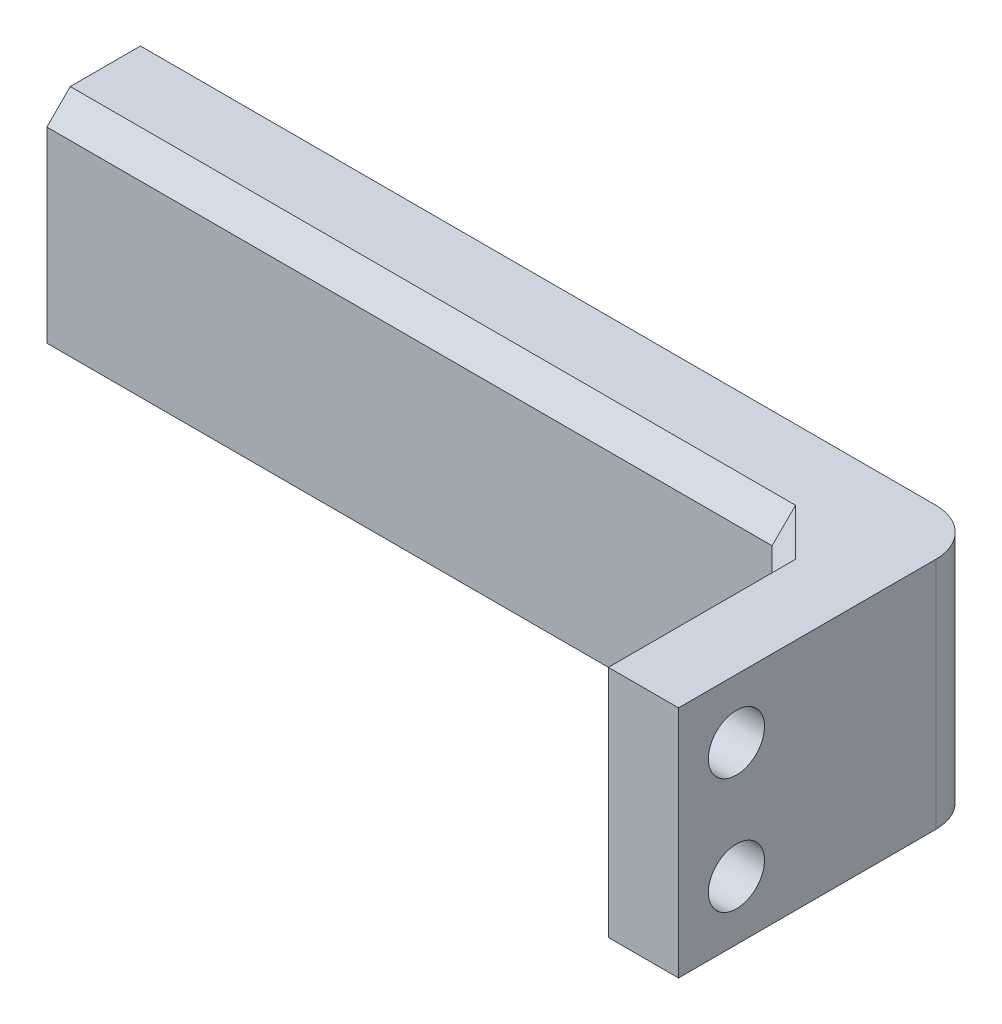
ISO-10303-21;
HEADER;
FILE_DESCRIPTION(('STEP AP214'),'2;1');
FILE_NAME('part.step','',(''),(''),'','','');
FILE_SCHEMA(('AUTOMOTIVE_DESIGN { 1 0 10303 214 1 1 1 1 }'));
ENDSEC;
DATA;
#1=APPLICATION_CONTEXT('core data for automotive mechanical design processes');
#2=APPLICATION_PROTOCOL_DEFINITION('international standard','automotive_design',2000,#1);
#3=PRODUCT_CONTEXT('',#1,'mechanical');
#4=PRODUCT('Part','Part','',(#3));
#5=PRODUCT_RELATED_PRODUCT_CATEGORY('part','',(#4));
#6=PRODUCT_DEFINITION_FORMATION('','',#4);
#7=PRODUCT_DEFINITION_CONTEXT('part definition',#1,'design');
#8=PRODUCT_DEFINITION('design','',#6,#7);
#9=PRODUCT_DEFINITION_SHAPE('','',#8);
#10=(LENGTH_UNIT() NAMED_UNIT(*) SI_UNIT(.MILLI.,.METRE.));
#11=(NAMED_UNIT(*) PLANE_ANGLE_UNIT() SI_UNIT($,.RADIAN.));
#12=(NAMED_UNIT(*) SI_UNIT($,.STERADIAN.) SOLID_ANGLE_UNIT());
#13=UNCERTAINTY_MEASURE_WITH_UNIT(LENGTH_MEASURE(1.E-05),#10,'distance_accuracy_value','');
#14=(GEOMETRIC_REPRESENTATION_CONTEXT(3) GLOBAL_UNCERTAINTY_ASSIGNED_CONTEXT((#13)) GLOBAL_UNIT_ASSIGNED_CONTEXT((#10,
#11,#12)) REPRESENTATION_CONTEXT('',''));
#15=CARTESIAN_POINT('',(0.,0.,0.));
#16=DIRECTION('',(0.,0.,1.));
#17=DIRECTION('',(1.,0.,0.));
#18=AXIS2_PLACEMENT_3D('',#15,#16,#17);
#19=CARTESIAN_POINT('',(0.,2.,0.));
#20=DIRECTION('',(0.,1.,0.));
#21=DIRECTION('',(0.,0.,1.));
#22=AXIS2_PLACEMENT_3D('',#19,#20,#21);
#23=PLANE('',#22);
#24=DIRECTION('',(-1.,0.,0.));
#25=VECTOR('',#24,1.);
#26=CARTESIAN_POINT('',(0.,2.,13.));
#27=LINE('',#26,#25);
#28=CARTESIAN_POINT('',(36.,2.,13.));
#29=VERTEX_POINT('',#28);
#30=CARTESIAN_POINT('',(33.,2.,13.));
#31=VERTEX_POINT('',#30);
#32=EDGE_CURVE('E198',#29,#31,#27,.T.);
#33=ORIENTED_EDGE('',*,*,#32,.T.);
#34=DIRECTION('',(0.,0.,-1.));
#35=VECTOR('',#34,1.);
#36=CARTESIAN_POINT('',(33.,2.,0.));
#37=LINE('',#36,#35);
#38=CARTESIAN_POINT('',(33.,2.,5.));
#39=VERTEX_POINT('',#38);
#40=EDGE_CURVE('E11',#31,#39,#37,.T.);
#41=ORIENTED_EDGE('',*,*,#40,.T.);
#42=DIRECTION('',(0.707106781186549,0.,0.707106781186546));
#43=VECTOR('',#42,1.);
#44=CARTESIAN_POINT('',(33.,2.,5.));
#45=LINE('',#44,#43);
#46=CARTESIAN_POINT('',(32.,2.,4.));
#47=VERTEX_POINT('',#46);
#48=EDGE_CURVE('E53',#47,#39,#45,.T.);
#49=ORIENTED_EDGE('',*,*,#48,.F.);
#50=DIRECTION('',(0.707106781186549,0.,0.707106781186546));
#51=VECTOR('',#50,1.);
#52=CARTESIAN_POINT('',(33.,2.,5.));
#53=LINE('',#52,#51);
#54=CARTESIAN_POINT('',(31.,2.,3.));
#55=VERTEX_POINT('',#54);
#56=EDGE_CURVE('E65',#55,#47,#53,.T.);
#57=ORIENTED_EDGE('',*,*,#56,.F.);
#58=DIRECTION('',(-1.,0.,0.));
#59=VECTOR('',#58,1.);
#60=CARTESIAN_POINT('',(0.,2.,3.));
#61=LINE('',#60,#59);
#62=CARTESIAN_POINT('',(0.,2.,3.));
#63=VERTEX_POINT('',#62);
#64=EDGE_CURVE('E308',#55,#63,#61,.T.);
#65=ORIENTED_EDGE('',*,*,#64,.T.);
#66=DIRECTION('',(0.,0.,1.));
#67=VECTOR('',#66,1.);
#68=CARTESIAN_POINT('',(0.,2.,0.));
#69=LINE('',#68,#67);
#70=CARTESIAN_POINT('',(0.,2.,0.));
#71=VERTEX_POINT('',#70);
#72=EDGE_CURVE('E162',#71,#63,#69,.T.);
#73=ORIENTED_EDGE('',*,*,#72,.F.);
#74=DIRECTION('',(-1.,0.,0.));
#75=VECTOR('',#74,1.);
#76=CARTESIAN_POINT('',(0.,2.,0.));
#77=LINE('',#76,#75);
#78=CARTESIAN_POINT('',(34.,2.,0.));
#79=VERTEX_POINT('',#78);
#80=EDGE_CURVE('E177',#79,#71,#77,.T.);
#81=ORIENTED_EDGE('',*,*,#80,.F.);
#82=CARTESIAN_POINT('',(34.,2.,2.));
#83=DIRECTION('',(0.,1.,0.));
#84=DIRECTION('',(0.,0.,1.));
#85=AXIS2_PLACEMENT_3D('',#82,#83,#84);
#86=CIRCLE('',#85,2.);
#87=CARTESIAN_POINT('',(36.,2.,2.));
#88=VERTEX_POINT('',#87);
#89=EDGE_CURVE('E214',#79,#88,#86,.F.);
#90=ORIENTED_EDGE('',*,*,#89,.T.);
#91=DIRECTION('',(0.,0.,1.));
#92=VECTOR('',#91,1.);
#93=CARTESIAN_POINT('',(36.,2.,0.));
#94=LINE('',#93,#92);
#95=EDGE_CURVE('E370',#88,#29,#94,.T.);
#96=ORIENTED_EDGE('',*,*,#95,.T.);
#97=EDGE_LOOP('',(#33,#41,#49,#57,#65,#73,#81,#90,#96));
#98=FACE_BOUND('',#97,.T.);
#99=ADVANCED_FACE('F41',(#98),#23,.F.);
#100=CARTESIAN_POINT('',(36.,12.,0.));
#101=DIRECTION('',(0.,-1.,0.));
#102=DIRECTION('',(1.,0.,0.));
#103=AXIS2_PLACEMENT_3D('',#100,#101,#102);
#104=PLANE('',#103);
#105=DIRECTION('',(0.,0.,1.));
#106=VECTOR('',#105,1.);
#107=CARTESIAN_POINT('',(0.,12.,0.));
#108=LINE('',#107,#106);
#109=CARTESIAN_POINT('',(0.,12.,0.));
#110=VERTEX_POINT('',#109);
#111=CARTESIAN_POINT('',(0.,12.,3.));
#112=VERTEX_POINT('',#111);
#113=EDGE_CURVE('E154',#110,#112,#108,.T.);
#114=ORIENTED_EDGE('',*,*,#113,.T.);
#115=DIRECTION('',(1.,0.,0.));
#116=VECTOR('',#115,1.);
#117=CARTESIAN_POINT('',(32.,12.,3.));
#118=LINE('',#117,#116);
#119=CARTESIAN_POINT('',(31.,12.,3.));
#120=VERTEX_POINT('',#119);
#121=EDGE_CURVE('E251',#112,#120,#118,.T.);
#122=ORIENTED_EDGE('',*,*,#121,.T.);
#123=DIRECTION('',(-0.707106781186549,0.,-0.707106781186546));
#124=VECTOR('',#123,1.);
#125=CARTESIAN_POINT('',(31.,12.,3.00000000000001));
#126=LINE('',#125,#124);
#127=CARTESIAN_POINT('',(32.,12.,4.));
#128=VERTEX_POINT('',#127);
#129=EDGE_CURVE('E247',#128,#120,#126,.T.);
#130=ORIENTED_EDGE('',*,*,#129,.F.);
#131=DIRECTION('',(-0.707106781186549,0.,-0.707106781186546));
#132=VECTOR('',#131,1.);
#133=CARTESIAN_POINT('',(31.,12.,3.00000000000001));
#134=LINE('',#133,#132);
#135=CARTESIAN_POINT('',(33.,12.,5.));
#136=VERTEX_POINT('',#135);
#137=EDGE_CURVE('E243',#136,#128,#134,.T.);
#138=ORIENTED_EDGE('',*,*,#137,.F.);
#139=DIRECTION('',(0.,0.,1.));
#140=VECTOR('',#139,1.);
#141=CARTESIAN_POINT('',(33.,12.,0.));
#142=LINE('',#141,#140);
#143=CARTESIAN_POINT('',(33.,12.,13.));
#144=VERTEX_POINT('',#143);
#145=EDGE_CURVE('E240',#136,#144,#142,.T.);
#146=ORIENTED_EDGE('',*,*,#145,.T.);
#147=DIRECTION('',(-1.,0.,0.));
#148=VECTOR('',#147,1.);
#149=CARTESIAN_POINT('',(0.,12.,13.));
#150=LINE('',#149,#148);
#151=CARTESIAN_POINT('',(36.,12.,13.));
#152=VERTEX_POINT('',#151);
#153=EDGE_CURVE('E185',#152,#144,#150,.T.);
#154=ORIENTED_EDGE('',*,*,#153,.F.);
#155=DIRECTION('',(0.,0.,1.));
#156=VECTOR('',#155,1.);
#157=CARTESIAN_POINT('',(36.,12.,0.));
#158=LINE('',#157,#156);
#159=CARTESIAN_POINT('',(36.,12.,2.));
#160=VERTEX_POINT('',#159);
#161=EDGE_CURVE('E173',#160,#152,#158,.T.);
#162=ORIENTED_EDGE('',*,*,#161,.F.);
#163=CARTESIAN_POINT('',(34.,12.,2.));
#164=DIRECTION('',(0.,-1.,0.));
#165=DIRECTION('',(1.,0.,0.));
#166=AXIS2_PLACEMENT_3D('',#163,#164,#165);
#167=CIRCLE('',#166,2.);
#168=CARTESIAN_POINT('',(34.,12.,0.));
#169=VERTEX_POINT('',#168);
#170=EDGE_CURVE('E157',#160,#169,#167,.F.);
#171=ORIENTED_EDGE('',*,*,#170,.T.);
#172=DIRECTION('',(1.,0.,0.));
#173=VECTOR('',#172,1.);
#174=CARTESIAN_POINT('',(36.,12.,0.));
#175=LINE('',#174,#173);
#176=EDGE_CURVE('E151',#110,#169,#175,.T.);
#177=ORIENTED_EDGE('',*,*,#176,.F.);
#178=EDGE_LOOP('',(#114,#122,#130,#138,#146,#154,#162,#171,#177));
#179=FACE_BOUND('',#178,.T.);
#180=ADVANCED_FACE('F153',(#179),#104,.F.);
#181=CARTESIAN_POINT('',(36.,0.,4.));
#182=DIRECTION('',(-1.,0.,0.));
#183=DIRECTION('',(0.,0.,1.));
#184=AXIS2_PLACEMENT_3D('',#181,#182,#183);
#185=PLANE('',#184);
#186=CARTESIAN_POINT('',(36.,9.47487373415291,10.5251262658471));
#187=DIRECTION('',(-1.,0.,0.));
#188=DIRECTION('',(0.,0.,1.));
#189=AXIS2_PLACEMENT_3D('',#186,#187,#188);
#190=CIRCLE('',#189,1.2);
#191=CARTESIAN_POINT('',(36.,9.47487373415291,11.7251262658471));
#192=VERTEX_POINT('',#191);
#193=EDGE_CURVE('E200',#192,#192,#190,.T.);
#194=ORIENTED_EDGE('',*,*,#193,.T.);
#195=EDGE_LOOP('',(#194));
#196=FACE_BOUND('',#195,.T.);
#197=CARTESIAN_POINT('',(36.,4.52512626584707,10.5251262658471));
#198=DIRECTION('',(-1.,0.,0.));
#199=DIRECTION('',(0.,0.,1.));
#200=AXIS2_PLACEMENT_3D('',#197,#198,#199);
#201=CIRCLE('',#200,1.2);
#202=CARTESIAN_POINT('',(36.,4.52512626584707,11.7251262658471));
#203=VERTEX_POINT('',#202);
#204=EDGE_CURVE('E194',#203,#203,#201,.T.);
#205=ORIENTED_EDGE('',*,*,#204,.T.);
#206=EDGE_LOOP('',(#205));
#207=FACE_BOUND('',#206,.T.);
#208=ORIENTED_EDGE('',*,*,#95,.F.);
#209=DIRECTION('',(0.,1.,0.));
#210=VECTOR('',#209,1.);
#211=CARTESIAN_POINT('',(36.,0.,2.));
#212=LINE('',#211,#210);
#213=EDGE_CURVE('E193',#88,#160,#212,.T.);
#214=ORIENTED_EDGE('',*,*,#213,.T.);
#215=ORIENTED_EDGE('',*,*,#161,.T.);
#216=DIRECTION('',(0.,1.,0.));
#217=VECTOR('',#216,1.);
#218=CARTESIAN_POINT('',(36.,14.,13.));
#219=LINE('',#218,#217);
#220=EDGE_CURVE('E181',#29,#152,#219,.T.);
#221=ORIENTED_EDGE('',*,*,#220,.F.);
#222=EDGE_LOOP('',(#208,#214,#215,#221));
#223=FACE_BOUND('',#222,.T.);
#224=ADVANCED_FACE('F386',(#196,#207,#223),#185,.F.);
#225=CARTESIAN_POINT('',(0.,0.,4.));
#226=DIRECTION('',(-1.,0.,0.));
#227=DIRECTION('',(0.,0.,1.));
#228=AXIS2_PLACEMENT_3D('',#225,#226,#227);
#229=PLANE('',#228);
#230=DIRECTION('',(0.,1.,0.));
#231=VECTOR('',#230,1.);
#232=CARTESIAN_POINT('',(0.,0.,4.));
#233=LINE('',#232,#231);
#234=CARTESIAN_POINT('',(0.,3.,4.));
#235=VERTEX_POINT('',#234);
#236=CARTESIAN_POINT('',(0.,11.,4.));
#237=VERTEX_POINT('',#236);
#238=EDGE_CURVE('E180',#235,#237,#233,.T.);
#239=ORIENTED_EDGE('',*,*,#238,.T.);
#240=DIRECTION('',(0.,0.707106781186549,-0.707106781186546));
#241=VECTOR('',#240,1.);
#242=CARTESIAN_POINT('',(0.,5.49999999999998,9.5));
#243=LINE('',#242,#241);
#244=EDGE_CURVE('E171',#237,#112,#243,.T.);
#245=ORIENTED_EDGE('',*,*,#244,.T.);
#246=ORIENTED_EDGE('',*,*,#113,.F.);
#247=DIRECTION('',(0.,1.,0.));
#248=VECTOR('',#247,1.);
#249=CARTESIAN_POINT('',(0.,0.,0.));
#250=LINE('',#249,#248);
#251=EDGE_CURVE('E169',#71,#110,#250,.T.);
#252=ORIENTED_EDGE('',*,*,#251,.F.);
#253=ORIENTED_EDGE('',*,*,#72,.T.);
#254=DIRECTION('',(0.,0.707106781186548,0.707106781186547));
#255=VECTOR('',#254,1.);
#256=CARTESIAN_POINT('',(0.,1.5,2.5));
#257=LINE('',#256,#255);
#258=EDGE_CURVE('E254',#63,#235,#257,.T.);
#259=ORIENTED_EDGE('',*,*,#258,.T.);
#260=EDGE_LOOP('',(#239,#245,#246,#252,#253,#259));
#261=FACE_BOUND('',#260,.T.);
#262=ADVANCED_FACE('F167',(#261),#229,.T.);
#263=CARTESIAN_POINT('',(0.,0.,4.));
#264=DIRECTION('',(0.,0.,1.));
#265=DIRECTION('',(1.,0.,0.));
#266=AXIS2_PLACEMENT_3D('',#263,#264,#265);
#267=PLANE('',#266);
#268=DIRECTION('',(0.,1.,0.));
#269=VECTOR('',#268,1.);
#270=CARTESIAN_POINT('',(31.,0.,4.));
#271=LINE('',#270,#269);
#272=CARTESIAN_POINT('',(31.,3.,4.));
#273=VERTEX_POINT('',#272);
#274=CARTESIAN_POINT('',(31.,11.,4.));
#275=VERTEX_POINT('',#274);
#276=EDGE_CURVE('E233',#273,#275,#271,.T.);
#277=ORIENTED_EDGE('',*,*,#276,.T.);
#278=DIRECTION('',(-1.,0.,0.));
#279=VECTOR('',#278,1.);
#280=CARTESIAN_POINT('',(0.,11.,4.));
#281=LINE('',#280,#279);
#282=EDGE_CURVE('E237',#275,#237,#281,.T.);
#283=ORIENTED_EDGE('',*,*,#282,.T.);
#284=ORIENTED_EDGE('',*,*,#238,.F.);
#285=DIRECTION('',(1.,0.,0.));
#286=VECTOR('',#285,1.);
#287=CARTESIAN_POINT('',(32.,3.,4.));
#288=LINE('',#287,#286);
#289=EDGE_CURVE('E230',#235,#273,#288,.T.);
#290=ORIENTED_EDGE('',*,*,#289,.T.);
#291=EDGE_LOOP('',(#277,#283,#284,#290));
#292=FACE_BOUND('',#291,.T.);
#293=ADVANCED_FACE('F434',(#292),#267,.T.);
#294=CARTESIAN_POINT('',(0.,0.,0.));
#295=DIRECTION('',(0.,0.,1.));
#296=DIRECTION('',(1.,0.,0.));
#297=AXIS2_PLACEMENT_3D('',#294,#295,#296);
#298=PLANE('',#297);
#299=ORIENTED_EDGE('',*,*,#176,.T.);
#300=DIRECTION('',(0.,1.,0.));
#301=VECTOR('',#300,1.);
#302=CARTESIAN_POINT('',(34.,0.,0.));
#303=LINE('',#302,#301);
#304=EDGE_CURVE('E211',#169,#79,#303,.F.);
#305=ORIENTED_EDGE('',*,*,#304,.T.);
#306=ORIENTED_EDGE('',*,*,#80,.T.);
#307=ORIENTED_EDGE('',*,*,#251,.T.);
#308=EDGE_LOOP('',(#299,#305,#306,#307));
#309=FACE_BOUND('',#308,.T.);
#310=ADVANCED_FACE('F175',(#309),#298,.F.);
#311=CARTESIAN_POINT('',(32.,14.,13.));
#312=DIRECTION('',(1.,0.,0.));
#313=DIRECTION('',(0.,0.,-1.));
#314=AXIS2_PLACEMENT_3D('',#311,#312,#313);
#315=PLANE('',#314);
#316=CARTESIAN_POINT('',(32.,4.52512626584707,10.5251262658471));
#317=DIRECTION('',(-1.,0.,0.));
#318=DIRECTION('',(0.,0.,1.));
#319=AXIS2_PLACEMENT_3D('',#316,#317,#318);
#320=CIRCLE('',#319,2.2);
#321=CARTESIAN_POINT('',(32.,6.15753168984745,12.));
#322=VERTEX_POINT('',#321);
#323=CARTESIAN_POINT('',(32.,3.,8.93956962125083));
#324=VERTEX_POINT('',#323);
#325=EDGE_CURVE('E204',#322,#324,#320,.T.);
#326=ORIENTED_EDGE('',*,*,#325,.F.);
#327=DIRECTION('',(0.,1.,0.));
#328=VECTOR('',#327,1.);
#329=CARTESIAN_POINT('',(32.,14.,12.));
#330=LINE('',#329,#328);
#331=CARTESIAN_POINT('',(32.,7.84246831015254,12.));
#332=VERTEX_POINT('',#331);
#333=EDGE_CURVE('E227',#322,#332,#330,.T.);
#334=ORIENTED_EDGE('',*,*,#333,.T.);
#335=CARTESIAN_POINT('',(32.,9.47487373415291,10.5251262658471));
#336=DIRECTION('',(-1.,0.,0.));
#337=DIRECTION('',(0.,0.,1.));
#338=AXIS2_PLACEMENT_3D('',#335,#336,#337);
#339=CIRCLE('',#338,2.2);
#340=CARTESIAN_POINT('',(32.,11.,8.93956962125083));
#341=VERTEX_POINT('',#340);
#342=EDGE_CURVE('E345',#341,#332,#339,.T.);
#343=ORIENTED_EDGE('',*,*,#342,.F.);
#344=DIRECTION('',(0.,0.,-1.));
#345=VECTOR('',#344,1.);
#346=CARTESIAN_POINT('',(32.,11.,13.));
#347=LINE('',#346,#345);
#348=CARTESIAN_POINT('',(32.,11.,5.));
#349=VERTEX_POINT('',#348);
#350=EDGE_CURVE('E224',#341,#349,#347,.T.);
#351=ORIENTED_EDGE('',*,*,#350,.T.);
#352=DIRECTION('',(0.,-1.,0.));
#353=VECTOR('',#352,1.);
#354=CARTESIAN_POINT('',(32.,14.,5.));
#355=LINE('',#354,#353);
#356=CARTESIAN_POINT('',(32.,3.,5.));
#357=VERTEX_POINT('',#356);
#358=EDGE_CURVE('E220',#349,#357,#355,.T.);
#359=ORIENTED_EDGE('',*,*,#358,.T.);
#360=DIRECTION('',(0.,0.,1.));
#361=VECTOR('',#360,1.);
#362=CARTESIAN_POINT('',(32.,3.,13.));
#363=LINE('',#362,#361);
#364=EDGE_CURVE('E217',#357,#324,#363,.T.);
#365=ORIENTED_EDGE('',*,*,#364,.T.);
#366=EDGE_LOOP('',(#326,#334,#343,#351,#359,#365));
#367=FACE_BOUND('',#366,.T.);
#368=ADVANCED_FACE('F396',(#367),#315,.F.);
#369=CARTESIAN_POINT('',(0.,0.,13.));
#370=DIRECTION('',(0.,0.,-1.));
#371=DIRECTION('',(-1.,0.,0.));
#372=AXIS2_PLACEMENT_3D('',#369,#370,#371);
#373=PLANE('',#372);
#374=ORIENTED_EDGE('',*,*,#153,.T.);
#375=DIRECTION('',(0.,-1.,0.));
#376=VECTOR('',#375,1.);
#377=CARTESIAN_POINT('',(33.,0.,13.));
#378=LINE('',#377,#376);
#379=EDGE_CURVE('E385',#144,#31,#378,.T.);
#380=ORIENTED_EDGE('',*,*,#379,.T.);
#381=ORIENTED_EDGE('',*,*,#32,.F.);
#382=ORIENTED_EDGE('',*,*,#220,.T.);
#383=EDGE_LOOP('',(#374,#380,#381,#382));
#384=FACE_BOUND('',#383,.T.);
#385=ADVANCED_FACE('F383',(#384),#373,.F.);
#386=CARTESIAN_POINT('',(32.,4.52512626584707,10.5251262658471));
#387=DIRECTION('',(-1.,0.,0.));
#388=DIRECTION('',(0.,0.,1.));
#389=AXIS2_PLACEMENT_3D('',#386,#387,#388);
#390=CYLINDRICAL_SURFACE('',#389,1.2);
#391=CARTESIAN_POINT('',(33.,4.52512626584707,10.5251262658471));
#392=DIRECTION('',(-1.,0.,0.));
#393=DIRECTION('',(0.,0.,1.));
#394=AXIS2_PLACEMENT_3D('',#391,#392,#393);
#395=CIRCLE('',#394,1.2);
#396=CARTESIAN_POINT('',(33.,4.52512626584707,11.7251262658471));
#397=VERTEX_POINT('',#396);
#398=EDGE_CURVE('E199',#397,#397,#395,.T.);
#399=ORIENTED_EDGE('',*,*,#398,.T.);
#400=EDGE_LOOP('',(#399));
#401=FACE_BOUND('',#400,.T.);
#402=ORIENTED_EDGE('',*,*,#204,.F.);
#403=EDGE_LOOP('',(#402));
#404=FACE_BOUND('',#403,.T.);
#405=ADVANCED_FACE('F289',(#401,#404),#390,.F.);
#406=CARTESIAN_POINT('',(32.,4.52512626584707,10.5251262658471));
#407=DIRECTION('',(-1.,0.,0.));
#408=DIRECTION('',(0.,0.,1.));
#409=AXIS2_PLACEMENT_3D('',#406,#407,#408);
#410=CONICAL_SURFACE('',#409,2.2,0.785398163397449);
#411=ORIENTED_EDGE('',*,*,#398,.F.);
#412=EDGE_LOOP('',(#411));
#413=FACE_BOUND('',#412,.T.);
#414=CARTESIAN_POINT('',(32.,3.,8.93956962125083));
#415=CARTESIAN_POINT('',(32.0374357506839,2.96256424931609,9.02750843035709));
#416=CARTESIAN_POINT('',(32.0726132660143,2.9273867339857,9.11748407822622));
#417=CARTESIAN_POINT('',(32.1376208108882,2.86237918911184,9.30153954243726));
#418=CARTESIAN_POINT('',(32.1674345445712,2.83256545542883,9.3956308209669));
#419=CARTESIAN_POINT('',(32.2206784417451,2.77932155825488,9.58752713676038));
#420=CARTESIAN_POINT('',(32.2441014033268,2.75589859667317,9.6853362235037));
#421=CARTESIAN_POINT('',(32.2835490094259,2.71645099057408,9.88380122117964));
#422=CARTESIAN_POINT('',(32.2995833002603,2.70041669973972,9.98445323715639));
#423=CARTESIAN_POINT('',(32.3204007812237,2.67959921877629,10.1610427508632));
#424=CARTESIAN_POINT('',(32.3270306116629,2.67296938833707,10.2365511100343));
#425=CARTESIAN_POINT('',(32.3356861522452,2.66431384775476,10.3880900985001));
#426=CARTESIAN_POINT('',(32.3377126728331,2.66228732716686,10.4641206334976));
#427=CARTESIAN_POINT('',(32.3371015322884,2.66289846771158,10.6159154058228));
#428=CARTESIAN_POINT('',(32.334477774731,2.66552222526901,10.6916797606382));
#429=CARTESIAN_POINT('',(32.3246721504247,2.67532784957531,10.842610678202));
#430=CARTESIAN_POINT('',(32.3174903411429,2.68250965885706,10.9177772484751));
#431=CARTESIAN_POINT('',(32.2988035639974,2.7011964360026,11.0667499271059));
#432=CARTESIAN_POINT('',(32.2873138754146,2.71268612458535,11.1405598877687));
#433=CARTESIAN_POINT('',(32.2603057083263,2.73969429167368,11.2867006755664));
#434=CARTESIAN_POINT('',(32.244785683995,2.75521431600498,11.3590309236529));
#435=CARTESIAN_POINT('',(32.1926720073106,2.80732799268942,11.57342676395));
#436=CARTESIAN_POINT('',(32.1505322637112,2.84946773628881,11.7128410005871));
#437=CARTESIAN_POINT('',(32.0803873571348,2.91961264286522,11.9104132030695));
#438=CARTESIAN_POINT('',(32.0569749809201,2.94302501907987,11.9719342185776));
#439=CARTESIAN_POINT('',(32.0324695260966,2.96753047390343,12.0324695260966));
#440=B_SPLINE_CURVE_WITH_KNOTS('',3,(#414,#415,#416,#417,#418,#419,#420,#421,#422,#423,#424,
#425,#426,#427,#428,#429,#430,#431,#432,#433,#434,#435,#436,#437,#438,#439),.UNSPECIFIED.,.F.,
.F.,(4,2,2,2,2,2,2,2,2,2,2,2,4),(0.,0.308015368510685,0.616951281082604,0.926233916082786,
1.23511161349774,1.46311644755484,1.69108113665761,1.91836539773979,2.145646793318,
2.37212957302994,2.59869934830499,3.05200948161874,3.26143738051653),.UNSPECIFIED.);
#441=CARTESIAN_POINT('',(32.0324695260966,2.96753047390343,12.0324695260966));
#442=VERTEX_POINT('',#441);
#443=EDGE_CURVE('E294',#324,#442,#440,.T.);
#444=ORIENTED_EDGE('',*,*,#443,.T.);
#445=CARTESIAN_POINT('',(32.0324695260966,2.96753047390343,12.0324695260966));
#446=CARTESIAN_POINT('',(32.069174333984,3.05411534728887,12.069174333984));
#447=CARTESIAN_POINT('',(32.1036542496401,3.14269802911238,12.1036542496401));
#448=CARTESIAN_POINT('',(32.1673502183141,3.32388248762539,12.1673502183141));
#449=CARTESIAN_POINT('',(32.1965503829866,3.41649538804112,12.1965503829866));
#450=CARTESIAN_POINT('',(32.2486794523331,3.60537449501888,12.2486794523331));
#451=CARTESIAN_POINT('',(32.2715999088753,3.70164542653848,12.2715999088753));
#452=CARTESIAN_POINT('',(32.3101704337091,3.89696675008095,12.3101704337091));
#453=CARTESIAN_POINT('',(32.3258298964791,3.99601337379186,12.3258298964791));
#454=CARTESIAN_POINT('',(32.3461500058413,4.16999280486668,12.3461500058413));
#455=CARTESIAN_POINT('',(32.3526105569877,4.24451119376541,12.3526105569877));
#456=CARTESIAN_POINT('',(32.3609855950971,4.39405353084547,12.3609855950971));
#457=CARTESIAN_POINT('',(32.3629008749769,4.46907738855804,12.3629008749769));
#458=CARTESIAN_POINT('',(32.3621289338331,4.61883045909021,12.3621289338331));
#459=CARTESIAN_POINT('',(32.3594567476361,4.6935598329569,12.3594567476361));
#460=CARTESIAN_POINT('',(32.3496193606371,4.84241814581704,12.3496193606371));
#461=CARTESIAN_POINT('',(32.3424542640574,4.91654709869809,12.3424542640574));
#462=CARTESIAN_POINT('',(32.3238685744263,5.06342623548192,12.3238685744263));
#463=CARTESIAN_POINT('',(32.3124647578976,5.13618068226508,12.3124647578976));
#464=CARTESIAN_POINT('',(32.2856930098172,5.28022440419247,12.2856930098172));
#465=CARTESIAN_POINT('',(32.2703234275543,5.3515130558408,12.2703234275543));
#466=CARTESIAN_POINT('',(32.2187120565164,5.56297313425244,12.2187120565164));
#467=CARTESIAN_POINT('',(32.1769944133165,5.7005390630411,12.1769944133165));
#468=CARTESIAN_POINT('',(32.1097711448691,5.88933320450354,12.1097711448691));
#469=CARTESIAN_POINT('',(32.0890027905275,5.94411743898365,12.0890027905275));
#470=CARTESIAN_POINT('',(32.0457527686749,6.05200531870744,12.0457527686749));
#471=CARTESIAN_POINT('',(32.0232789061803,6.10511521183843,12.0232789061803));
#472=CARTESIAN_POINT('',(32.,6.15753168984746,12.));
#473=B_SPLINE_CURVE_WITH_KNOTS('',3,(#445,#446,#447,#448,#449,#450,#451,#452,#453,#454,#455,
#456,#457,#458,#459,#460,#461,#462,#463,#464,#465,#466,#467,#468,#469,#470,#471,#472),
.UNSPECIFIED.,.F.,.F.,(4,2,2,2,2,2,2,2,2,2,2,2,2,4),(0.,0.302934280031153,0.606765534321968,
0.911003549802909,1.21484682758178,1.43981907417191,1.66475207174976,1.88894928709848,
2.11314130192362,2.33645527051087,2.55986234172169,3.00728006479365,3.19372211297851,
3.37935716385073),.UNSPECIFIED.);
#474=EDGE_CURVE('E301',#442,#322,#473,.T.);
#475=ORIENTED_EDGE('',*,*,#474,.T.);
#476=ORIENTED_EDGE('',*,*,#325,.T.);
#477=EDGE_LOOP('',(#444,#475,#476));
#478=FACE_BOUND('',#477,.T.);
#479=ADVANCED_FACE('F284',(#413,#478),#410,.F.);
#480=CARTESIAN_POINT('',(32.,9.47487373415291,10.5251262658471));
#481=DIRECTION('',(-1.,0.,0.));
#482=DIRECTION('',(0.,0.,1.));
#483=AXIS2_PLACEMENT_3D('',#480,#481,#482);
#484=CYLINDRICAL_SURFACE('',#483,1.2);
#485=CARTESIAN_POINT('',(33.,9.47487373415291,10.5251262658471));
#486=DIRECTION('',(-1.,0.,0.));
#487=DIRECTION('',(0.,0.,1.));
#488=AXIS2_PLACEMENT_3D('',#485,#486,#487);
#489=CIRCLE('',#488,1.2);
#490=CARTESIAN_POINT('',(33.,9.47487373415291,11.7251262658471));
#491=VERTEX_POINT('',#490);
#492=EDGE_CURVE('E205',#491,#491,#489,.T.);
#493=ORIENTED_EDGE('',*,*,#492,.T.);
#494=EDGE_LOOP('',(#493));
#495=FACE_BOUND('',#494,.T.);
#496=ORIENTED_EDGE('',*,*,#193,.F.);
#497=EDGE_LOOP('',(#496));
#498=FACE_BOUND('',#497,.T.);
#499=ADVANCED_FACE('F279',(#495,#498),#484,.F.);
#500=CARTESIAN_POINT('',(32.,9.47487373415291,10.5251262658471));
#501=DIRECTION('',(-1.,0.,0.));
#502=DIRECTION('',(0.,0.,1.));
#503=AXIS2_PLACEMENT_3D('',#500,#501,#502);
#504=CONICAL_SURFACE('',#503,2.2,0.785398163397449);
#505=ORIENTED_EDGE('',*,*,#492,.F.);
#506=EDGE_LOOP('',(#505));
#507=FACE_BOUND('',#506,.T.);
#508=CARTESIAN_POINT('',(32.,7.84246831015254,12.));
#509=CARTESIAN_POINT('',(32.0392703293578,7.93086788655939,12.0392703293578));
#510=CARTESIAN_POINT('',(32.076289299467,8.02139191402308,12.076289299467));
#511=CARTESIAN_POINT('',(32.1449493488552,8.20679468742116,12.1449493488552));
#512=CARTESIAN_POINT('',(32.1765722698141,8.30168682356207,12.1765722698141));
#513=CARTESIAN_POINT('',(32.2333558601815,8.49556130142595,12.2333558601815));
#514=CARTESIAN_POINT('',(32.2585019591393,8.59455229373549,12.2585019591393));
#515=CARTESIAN_POINT('',(32.3011673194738,8.79566504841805,12.3011673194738));
#516=CARTESIAN_POINT('',(32.3186975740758,8.89778206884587,12.3186975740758));
#517=CARTESIAN_POINT('',(32.3415241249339,9.0747650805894,12.3415241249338));
#518=CARTESIAN_POINT('',(32.348882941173,9.14910679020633,12.348882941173));
#519=CARTESIAN_POINT('',(32.3590833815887,9.29840318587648,12.3590833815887));
#520=CARTESIAN_POINT('',(32.3619259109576,9.37335774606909,12.3619259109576));
#521=CARTESIAN_POINT('',(32.3630069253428,9.52306636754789,12.3630069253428));
#522=CARTESIAN_POINT('',(32.361261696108,9.59782019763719,12.361261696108));
#523=CARTESIAN_POINT('',(32.3532551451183,9.74683635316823,12.3532551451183));
#524=CARTESIAN_POINT('',(32.3469939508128,9.82109869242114,12.3469939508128));
#525=CARTESIAN_POINT('',(32.330160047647,9.96839169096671,12.330160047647));
#526=CARTESIAN_POINT('',(32.3196012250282,10.0414255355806,12.3196012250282));
#527=CARTESIAN_POINT('',(32.2944520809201,10.1860998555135,12.2944520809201));
#528=CARTESIAN_POINT('',(32.2798600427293,10.2577397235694,12.2798600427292));
#529=CARTESIAN_POINT('',(32.2304718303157,10.4703121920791,12.2304718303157));
#530=CARTESIAN_POINT('',(32.1900850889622,10.6087205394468,12.1900850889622));
#531=CARTESIAN_POINT('',(32.1267368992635,10.7923456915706,12.1267368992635));
#532=CARTESIAN_POINT('',(32.1088544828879,10.8412722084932,12.1088544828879));
#533=CARTESIAN_POINT('',(32.0716897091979,10.9378005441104,12.0716897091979));
#534=CARTESIAN_POINT('',(32.0524131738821,10.9854068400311,12.0524131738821));
#535=CARTESIAN_POINT('',(32.0324695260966,11.0324695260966,12.0324695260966));
#536=B_SPLINE_CURVE_WITH_KNOTS('',3,(#508,#509,#510,#511,#512,#513,#514,#515,#516,#517,#518,
#519,#520,#521,#522,#523,#524,#525,#526,#527,#528,#529,#530,#531,#532,#533,#534,#535),
.UNSPECIFIED.,.F.,.F.,(4,2,2,2,2,2,2,2,2,2,2,2,2,4),(0.,0.313281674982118,0.627597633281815,
0.942614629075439,1.25717538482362,1.48212322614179,1.70702597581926,1.93113143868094,
2.15523057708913,2.37861129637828,2.60208724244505,3.0495728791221,3.21477558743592,
3.37932432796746),.UNSPECIFIED.);
#537=CARTESIAN_POINT('',(32.0324695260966,11.0324695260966,12.0324695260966));
#538=VERTEX_POINT('',#537);
#539=EDGE_CURVE('E259',#332,#538,#536,.T.);
#540=ORIENTED_EDGE('',*,*,#539,.T.);
#541=CARTESIAN_POINT('',(32.0324695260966,11.0324695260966,12.0324695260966));
#542=CARTESIAN_POINT('',(32.0673381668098,11.0673381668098,11.9463190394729));
#543=CARTESIAN_POINT('',(32.0999739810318,11.0999739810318,11.8582590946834));
#544=CARTESIAN_POINT('',(32.1600106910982,11.1600106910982,11.6783676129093));
#545=CARTESIAN_POINT('',(32.1873974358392,11.1873974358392,11.5865266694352));
#546=CARTESIAN_POINT('',(32.2359784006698,11.2359784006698,11.3995579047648));
#547=CARTESIAN_POINT('',(32.2571710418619,11.2571710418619,11.3044292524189));
#548=CARTESIAN_POINT('',(32.2925034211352,11.2925034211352,11.1116682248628));
#549=CARTESIAN_POINT('',(32.30665134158,11.30665134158,11.0140388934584));
#550=CARTESIAN_POINT('',(32.3248604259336,11.3248604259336,10.8403568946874));
#551=CARTESIAN_POINT('',(32.3305117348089,11.3305117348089,10.7646329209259));
#552=CARTESIAN_POINT('',(32.3371787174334,11.3371787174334,10.6127809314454));
#553=CARTESIAN_POINT('',(32.3381950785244,11.3381950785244,10.5366529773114));
#554=CARTESIAN_POINT('',(32.3355647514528,11.3355647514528,10.3847672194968));
#555=CARTESIAN_POINT('',(32.3319306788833,11.3319306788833,10.3090089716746));
#556=CARTESIAN_POINT('',(32.3201296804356,11.3201296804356,10.1582077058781));
#557=CARTESIAN_POINT('',(32.3119627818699,11.3119627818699,10.0831646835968));
#558=CARTESIAN_POINT('',(32.2913670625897,11.2913670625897,9.93459562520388));
#559=CARTESIAN_POINT('',(32.2789565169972,11.2789565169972,9.86106449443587));
#560=CARTESIAN_POINT('',(32.2501780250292,11.2501780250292,9.7155572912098));
#561=CARTESIAN_POINT('',(32.2338086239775,11.2338086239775,9.6435818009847));
#562=CARTESIAN_POINT('',(32.1792645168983,11.1792645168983,9.43031189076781));
#563=CARTESIAN_POINT('',(32.1356661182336,11.1356661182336,9.29175733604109));
#564=CARTESIAN_POINT('',(32.0592252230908,11.0592252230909,9.08350921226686));
#565=CARTESIAN_POINT('',(32.0303476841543,11.0303476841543,9.0108393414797));
#566=CARTESIAN_POINT('',(32.,11.,8.93956962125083));
#567=B_SPLINE_CURVE_WITH_KNOTS('',3,(#541,#542,#543,#544,#545,#546,#547,#548,#549,#550,#551,
#552,#553,#554,#555,#556,#557,#558,#559,#560,#561,#562,#563,#564,#565,#566),.UNSPECIFIED.,.F.,
.F.,(4,2,2,2,2,2,2,2,2,2,2,2,4),(0.,0.297861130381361,0.596514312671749,0.89524355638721,
1.19362501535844,1.42179329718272,1.6499277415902,1.87744461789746,2.10496012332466,
2.33150792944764,2.55813910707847,3.01165415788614,3.26146308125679),.UNSPECIFIED.);
#568=EDGE_CURVE('E267',#538,#341,#567,.T.);
#569=ORIENTED_EDGE('',*,*,#568,.T.);
#570=ORIENTED_EDGE('',*,*,#342,.T.);
#571=EDGE_LOOP('',(#540,#569,#570));
#572=FACE_BOUND('',#571,.T.);
#573=ADVANCED_FACE('F274',(#507,#572),#504,.F.);
#574=CARTESIAN_POINT('',(34.,0.,2.));
#575=DIRECTION('',(0.,1.,0.));
#576=DIRECTION('',(0.,0.,1.));
#577=AXIS2_PLACEMENT_3D('',#574,#575,#576);
#578=CYLINDRICAL_SURFACE('',#577,2.);
#579=ORIENTED_EDGE('',*,*,#89,.F.);
#580=ORIENTED_EDGE('',*,*,#304,.F.);
#581=ORIENTED_EDGE('',*,*,#170,.F.);
#582=ORIENTED_EDGE('',*,*,#213,.F.);
#583=EDGE_LOOP('',(#579,#580,#581,#582));
#584=FACE_BOUND('',#583,.T.);
#585=ADVANCED_FACE('F278',(#584),#578,.T.);
#586=CARTESIAN_POINT('',(33.,0.,13.));
#587=DIRECTION('',(0.707106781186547,0.,-0.707106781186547));
#588=DIRECTION('',(0.,-1.,0.));
#589=AXIS2_PLACEMENT_3D('',#586,#587,#588);
#590=PLANE('',#589);
#591=DIRECTION('',(-0.577350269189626,0.577350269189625,-0.577350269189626));
#592=VECTOR('',#591,1.);
#593=CARTESIAN_POINT('',(32.3333333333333,2.66666666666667,12.3333333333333));
#594=LINE('',#593,#592);
#595=EDGE_CURVE('E337',#31,#442,#594,.T.);
#596=ORIENTED_EDGE('',*,*,#595,.F.);
#597=ORIENTED_EDGE('',*,*,#379,.F.);
#598=DIRECTION('',(-0.577350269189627,-0.577350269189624,-0.577350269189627));
#599=VECTOR('',#598,1.);
#600=CARTESIAN_POINT('',(29.,8.00000000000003,9.00000000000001));
#601=LINE('',#600,#599);
#602=EDGE_CURVE('E47',#538,#144,#601,.F.);
#603=ORIENTED_EDGE('',*,*,#602,.F.);
#604=ORIENTED_EDGE('',*,*,#539,.F.);
#605=ORIENTED_EDGE('',*,*,#333,.F.);
#606=ORIENTED_EDGE('',*,*,#474,.F.);
#607=EDGE_LOOP('',(#596,#597,#603,#604,#605,#606));
#608=FACE_BOUND('',#607,.T.);
#609=ADVANCED_FACE('F44',(#608),#590,.F.);
#610=CARTESIAN_POINT('',(36.,12.,3.));
#611=DIRECTION('',(0.,0.707106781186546,0.707106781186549));
#612=DIRECTION('',(-1.,0.,0.));
#613=AXIS2_PLACEMENT_3D('',#610,#611,#612);
#614=PLANE('',#613);
#615=ORIENTED_EDGE('',*,*,#244,.F.);
#616=ORIENTED_EDGE('',*,*,#282,.F.);
#617=DIRECTION('',(0.,-0.707106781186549,0.707106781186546));
#618=VECTOR('',#617,1.);
#619=CARTESIAN_POINT('',(31.,12.,3.));
#620=LINE('',#619,#618);
#621=EDGE_CURVE('E334',#120,#275,#620,.T.);
#622=ORIENTED_EDGE('',*,*,#621,.F.);
#623=ORIENTED_EDGE('',*,*,#121,.F.);
#624=EDGE_LOOP('',(#615,#616,#622,#623));
#625=FACE_BOUND('',#624,.T.);
#626=ADVANCED_FACE('F421',(#625),#614,.T.);
#627=CARTESIAN_POINT('',(32.,11.,13.));
#628=DIRECTION('',(0.707106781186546,-0.707106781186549,0.));
#629=DIRECTION('',(0.,0.,-1.));
#630=AXIS2_PLACEMENT_3D('',#627,#628,#629);
#631=PLANE('',#630);
#632=ORIENTED_EDGE('',*,*,#602,.T.);
#633=ORIENTED_EDGE('',*,*,#145,.F.);
#634=DIRECTION('',(0.707106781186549,0.707106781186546,0.));
#635=VECTOR('',#634,1.);
#636=CARTESIAN_POINT('',(32.,11.,5.));
#637=LINE('',#636,#635);
#638=EDGE_CURVE('E330',#349,#136,#637,.T.);
#639=ORIENTED_EDGE('',*,*,#638,.F.);
#640=ORIENTED_EDGE('',*,*,#350,.F.);
#641=ORIENTED_EDGE('',*,*,#568,.F.);
#642=EDGE_LOOP('',(#632,#633,#639,#640,#641));
#643=FACE_BOUND('',#642,.T.);
#644=ADVANCED_FACE('F399',(#643),#631,.F.);
#645=CARTESIAN_POINT('',(32.,3.,13.));
#646=DIRECTION('',(0.707106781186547,0.707106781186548,0.));
#647=DIRECTION('',(0.,0.,1.));
#648=AXIS2_PLACEMENT_3D('',#645,#646,#647);
#649=PLANE('',#648);
#650=ORIENTED_EDGE('',*,*,#443,.F.);
#651=ORIENTED_EDGE('',*,*,#364,.F.);
#652=DIRECTION('',(-0.707106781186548,0.707106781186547,0.));
#653=VECTOR('',#652,1.);
#654=CARTESIAN_POINT('',(33.,2.,5.));
#655=LINE('',#654,#653);
#656=EDGE_CURVE('E326',#39,#357,#655,.T.);
#657=ORIENTED_EDGE('',*,*,#656,.F.);
#658=ORIENTED_EDGE('',*,*,#40,.F.);
#659=ORIENTED_EDGE('',*,*,#595,.T.);
#660=EDGE_LOOP('',(#650,#651,#657,#658,#659));
#661=FACE_BOUND('',#660,.T.);
#662=ADVANCED_FACE('F412',(#661),#649,.F.);
#663=CARTESIAN_POINT('',(0.,2.,3.));
#664=DIRECTION('',(0.,-0.707106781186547,0.707106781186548));
#665=DIRECTION('',(1.,0.,0.));
#666=AXIS2_PLACEMENT_3D('',#663,#664,#665);
#667=PLANE('',#666);
#668=ORIENTED_EDGE('',*,*,#258,.F.);
#669=ORIENTED_EDGE('',*,*,#64,.F.);
#670=DIRECTION('',(0.,-0.707106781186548,-0.707106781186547));
#671=VECTOR('',#670,1.);
#672=CARTESIAN_POINT('',(31.,3.,4.));
#673=LINE('',#672,#671);
#674=EDGE_CURVE('E322',#273,#55,#673,.T.);
#675=ORIENTED_EDGE('',*,*,#674,.F.);
#676=ORIENTED_EDGE('',*,*,#289,.F.);
#677=EDGE_LOOP('',(#668,#669,#675,#676));
#678=FACE_BOUND('',#677,.T.);
#679=ADVANCED_FACE('F414',(#678),#667,.T.);
#680=CARTESIAN_POINT('',(31.,11.,4.));
#681=DIRECTION('',(-0.577350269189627,0.577350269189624,0.577350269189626));
#682=DIRECTION('',(0.707106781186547,0.,0.707106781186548));
#683=AXIS2_PLACEMENT_3D('',#680,#681,#682);
#684=PLANE('',#683);
#685=ORIENTED_EDGE('',*,*,#129,.T.);
#686=ORIENTED_EDGE('',*,*,#621,.T.);
#687=DIRECTION('',(0.707106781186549,0.,0.707106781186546));
#688=VECTOR('',#687,1.);
#689=CARTESIAN_POINT('',(31.,11.,4.));
#690=LINE('',#689,#688);
#691=EDGE_CURVE('E319',#349,#275,#690,.F.);
#692=ORIENTED_EDGE('',*,*,#691,.F.);
#693=ORIENTED_EDGE('',*,*,#638,.T.);
#694=ORIENTED_EDGE('',*,*,#137,.T.);
#695=EDGE_LOOP('',(#685,#686,#692,#693,#694));
#696=FACE_BOUND('',#695,.T.);
#697=ADVANCED_FACE('F403',(#696),#684,.T.);
#698=CARTESIAN_POINT('',(32.,3.,5.));
#699=DIRECTION('',(-0.577350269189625,-0.577350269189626,0.577350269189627));
#700=DIRECTION('',(0.,-0.707106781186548,-0.707106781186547));
#701=AXIS2_PLACEMENT_3D('',#698,#699,#700);
#702=PLANE('',#701);
#703=ORIENTED_EDGE('',*,*,#48,.T.);
#704=ORIENTED_EDGE('',*,*,#656,.T.);
#705=DIRECTION('',(-0.707106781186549,0.,-0.707106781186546));
#706=VECTOR('',#705,1.);
#707=CARTESIAN_POINT('',(32.,3.,5.));
#708=LINE('',#707,#706);
#709=EDGE_CURVE('E316',#273,#357,#708,.F.);
#710=ORIENTED_EDGE('',*,*,#709,.F.);
#711=ORIENTED_EDGE('',*,*,#674,.T.);
#712=ORIENTED_EDGE('',*,*,#56,.T.);
#713=EDGE_LOOP('',(#703,#704,#710,#711,#712));
#714=FACE_BOUND('',#713,.T.);
#715=ADVANCED_FACE('F454',(#714),#702,.T.);
#716=CARTESIAN_POINT('',(32.,14.,5.));
#717=DIRECTION('',(0.707106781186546,0.,-0.707106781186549));
#718=DIRECTION('',(0.,-1.,0.));
#719=AXIS2_PLACEMENT_3D('',#716,#717,#718);
#720=PLANE('',#719);
#721=ORIENTED_EDGE('',*,*,#691,.T.);
#722=ORIENTED_EDGE('',*,*,#276,.F.);
#723=ORIENTED_EDGE('',*,*,#709,.T.);
#724=ORIENTED_EDGE('',*,*,#358,.F.);
#725=EDGE_LOOP('',(#721,#722,#723,#724));
#726=FACE_BOUND('',#725,.T.);
#727=ADVANCED_FACE('F408',(#726),#720,.F.);
#728=CLOSED_SHELL('',(#99,#180,#224,#262,#293,#310,#368,#385,#405,#479,#499,#573,#585,#609,#626,
#644,#662,#679,#697,#715,#727));
#729=MANIFOLD_SOLID_BREP('B2',#728);
#730=ADVANCED_BREP_SHAPE_REPRESENTATION('',(#18,#729),#14);
#731=SHAPE_DEFINITION_REPRESENTATION(#9,#730);
ENDSEC;
END-ISO-10303-21;
